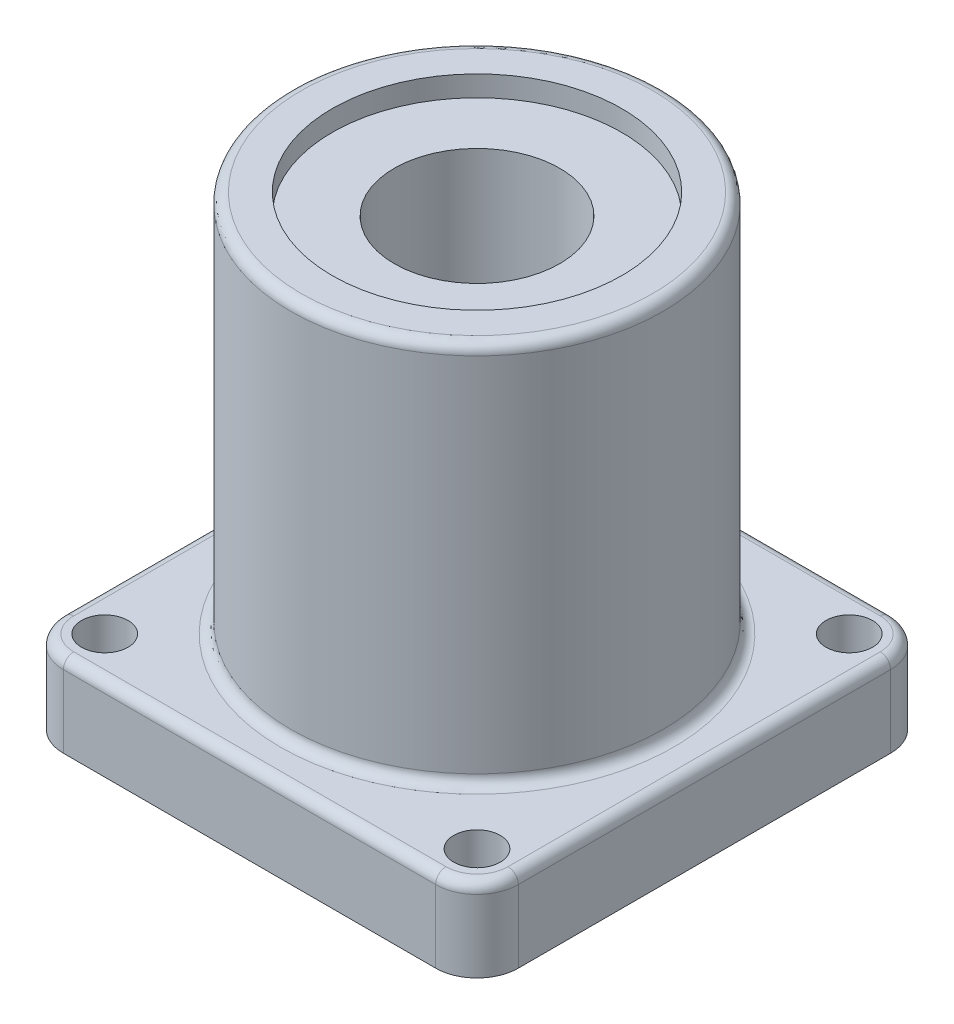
ISO-10303-21;
HEADER;
FILE_DESCRIPTION(('STEP AP214'),'2;1');
FILE_NAME('part.step','',(''),(''),'','','');
FILE_SCHEMA(('AUTOMOTIVE_DESIGN { 1 0 10303 214 1 1 1 1 }'));
ENDSEC;
DATA;
#1=APPLICATION_CONTEXT('core data for automotive mechanical design processes');
#2=APPLICATION_PROTOCOL_DEFINITION('international standard','automotive_design',2000,#1);
#3=PRODUCT_CONTEXT('',#1,'mechanical');
#4=PRODUCT('Part','Part','',(#3));
#5=PRODUCT_RELATED_PRODUCT_CATEGORY('part','',(#4));
#6=PRODUCT_DEFINITION_FORMATION('','',#4);
#7=PRODUCT_DEFINITION_CONTEXT('part definition',#1,'design');
#8=PRODUCT_DEFINITION('design','',#6,#7);
#9=PRODUCT_DEFINITION_SHAPE('','',#8);
#10=(LENGTH_UNIT() NAMED_UNIT(*) SI_UNIT(.MILLI.,.METRE.));
#11=(NAMED_UNIT(*) PLANE_ANGLE_UNIT() SI_UNIT($,.RADIAN.));
#12=(NAMED_UNIT(*) SI_UNIT($,.STERADIAN.) SOLID_ANGLE_UNIT());
#13=UNCERTAINTY_MEASURE_WITH_UNIT(LENGTH_MEASURE(1.E-05),#10,'distance_accuracy_value','');
#14=(GEOMETRIC_REPRESENTATION_CONTEXT(3) GLOBAL_UNCERTAINTY_ASSIGNED_CONTEXT((#13)) GLOBAL_UNIT_ASSIGNED_CONTEXT((#10,
#11,#12)) REPRESENTATION_CONTEXT('',''));
#15=CARTESIAN_POINT('',(0.,0.,0.));
#16=DIRECTION('',(0.,0.,1.));
#17=DIRECTION('',(1.,0.,0.));
#18=AXIS2_PLACEMENT_3D('',#15,#16,#17);
#19=CARTESIAN_POINT('',(0.,0.,0.));
#20=DIRECTION('',(0.,1.,0.));
#21=DIRECTION('',(0.,0.,1.));
#22=AXIS2_PLACEMENT_3D('',#19,#20,#21);
#23=CYLINDRICAL_SURFACE('',#22,12.7);
#24=CARTESIAN_POINT('',(0.,0.,0.));
#25=DIRECTION('',(0.,1.,0.));
#26=DIRECTION('',(0.,0.,1.));
#27=AXIS2_PLACEMENT_3D('',#24,#25,#26);
#28=CIRCLE('',#27,12.7);
#29=CARTESIAN_POINT('',(0.,0.,12.7));
#30=VERTEX_POINT('',#29);
#31=EDGE_CURVE('E281',#30,#30,#28,.T.);
#32=ORIENTED_EDGE('',*,*,#31,.F.);
#33=EDGE_LOOP('',(#32));
#34=FACE_BOUND('',#33,.T.);
#35=CARTESIAN_POINT('',(0.,68.2625,0.));
#36=DIRECTION('',(0.,1.,0.));
#37=DIRECTION('',(0.,0.,1.));
#38=AXIS2_PLACEMENT_3D('',#35,#36,#37);
#39=CIRCLE('',#38,12.7);
#40=CARTESIAN_POINT('',(0.,68.2625,12.7));
#41=VERTEX_POINT('',#40);
#42=EDGE_CURVE('E155',#41,#41,#39,.F.);
#43=ORIENTED_EDGE('',*,*,#42,.F.);
#44=EDGE_LOOP('',(#43));
#45=FACE_BOUND('',#44,.T.);
#46=ADVANCED_FACE('F36',(#34,#45),#23,.F.);
#47=CARTESIAN_POINT('',(-34.925,12.7,34.925));
#48=DIRECTION('',(0.,-1.,0.));
#49=DIRECTION('',(0.,0.,-1.));
#50=AXIS2_PLACEMENT_3D('',#47,#48,#49);
#51=PLANE('',#50);
#52=CARTESIAN_POINT('',(0.,12.7,0.));
#53=DIRECTION('',(0.,-1.,0.));
#54=DIRECTION('',(0.,0.,-1.));
#55=AXIS2_PLACEMENT_3D('',#52,#53,#54);
#56=CIRCLE('',#55,30.1625);
#57=CARTESIAN_POINT('',(0.,12.7,-30.1625));
#58=VERTEX_POINT('',#57);
#59=EDGE_CURVE('E199',#58,#58,#56,.T.);
#60=ORIENTED_EDGE('',*,*,#59,.T.);
#61=EDGE_LOOP('',(#60));
#62=FACE_BOUND('',#61,.T.);
#63=CARTESIAN_POINT('',(-28.575,12.7,-28.575));
#64=DIRECTION('',(0.,-1.,0.));
#65=DIRECTION('',(0.,0.,-1.));
#66=AXIS2_PLACEMENT_3D('',#63,#64,#65);
#67=CIRCLE('',#66,4.7625);
#68=CARTESIAN_POINT('',(-28.575,12.7,-33.3375));
#69=VERTEX_POINT('',#68);
#70=CARTESIAN_POINT('',(-33.3375,12.7,-28.575));
#71=VERTEX_POINT('',#70);
#72=EDGE_CURVE('E194',#69,#71,#67,.F.);
#73=ORIENTED_EDGE('',*,*,#72,.T.);
#74=DIRECTION('',(0.,0.,-1.));
#75=VECTOR('',#74,1.);
#76=CARTESIAN_POINT('',(-33.3375,12.7,28.575));
#77=LINE('',#76,#75);
#78=CARTESIAN_POINT('',(-33.3375,12.7,28.575));
#79=VERTEX_POINT('',#78);
#80=EDGE_CURVE('E196',#71,#79,#77,.F.);
#81=ORIENTED_EDGE('',*,*,#80,.T.);
#82=CARTESIAN_POINT('',(-28.575,12.7,28.575));
#83=DIRECTION('',(0.,-1.,0.));
#84=DIRECTION('',(0.,0.,-1.));
#85=AXIS2_PLACEMENT_3D('',#82,#83,#84);
#86=CIRCLE('',#85,4.7625);
#87=CARTESIAN_POINT('',(-28.575,12.7,33.3375));
#88=VERTEX_POINT('',#87);
#89=EDGE_CURVE('E192',#79,#88,#86,.F.);
#90=ORIENTED_EDGE('',*,*,#89,.T.);
#91=DIRECTION('',(1.,0.,0.));
#92=VECTOR('',#91,1.);
#93=CARTESIAN_POINT('',(-34.925,12.7,33.3375));
#94=LINE('',#93,#92);
#95=CARTESIAN_POINT('',(28.575,12.7,33.3375));
#96=VERTEX_POINT('',#95);
#97=EDGE_CURVE('E188',#88,#96,#94,.T.);
#98=ORIENTED_EDGE('',*,*,#97,.T.);
#99=CARTESIAN_POINT('',(28.575,12.7,28.575));
#100=DIRECTION('',(0.,-1.,0.));
#101=DIRECTION('',(0.,0.,-1.));
#102=AXIS2_PLACEMENT_3D('',#99,#100,#101);
#103=CIRCLE('',#102,4.7625);
#104=CARTESIAN_POINT('',(33.3375,12.7,28.575));
#105=VERTEX_POINT('',#104);
#106=EDGE_CURVE('E184',#96,#105,#103,.F.);
#107=ORIENTED_EDGE('',*,*,#106,.T.);
#108=DIRECTION('',(0.,0.,1.));
#109=VECTOR('',#108,1.);
#110=CARTESIAN_POINT('',(33.3375,12.7,-28.575));
#111=LINE('',#110,#109);
#112=CARTESIAN_POINT('',(33.3375,12.7,-28.575));
#113=VERTEX_POINT('',#112);
#114=EDGE_CURVE('E181',#105,#113,#111,.F.);
#115=ORIENTED_EDGE('',*,*,#114,.T.);
#116=CARTESIAN_POINT('',(28.575,12.7,-28.575));
#117=DIRECTION('',(0.,-1.,0.));
#118=DIRECTION('',(0.,0.,-1.));
#119=AXIS2_PLACEMENT_3D('',#116,#117,#118);
#120=CIRCLE('',#119,4.7625);
#121=CARTESIAN_POINT('',(28.575,12.7,-33.3375));
#122=VERTEX_POINT('',#121);
#123=EDGE_CURVE('E186',#113,#122,#120,.F.);
#124=ORIENTED_EDGE('',*,*,#123,.T.);
#125=DIRECTION('',(-1.,0.,0.));
#126=VECTOR('',#125,1.);
#127=CARTESIAN_POINT('',(-34.925,12.7,-33.3375));
#128=LINE('',#127,#126);
#129=EDGE_CURVE('E190',#122,#69,#128,.T.);
#130=ORIENTED_EDGE('',*,*,#129,.T.);
#131=EDGE_LOOP('',(#73,#81,#90,#98,#107,#115,#124,#130));
#132=FACE_BOUND('',#131,.T.);
#133=CARTESIAN_POINT('',(-28.575,12.7,-28.575));
#134=DIRECTION('',(0.,-1.,0.));
#135=DIRECTION('',(0.,0.,-1.));
#136=AXIS2_PLACEMENT_3D('',#133,#134,#135);
#137=CIRCLE('',#136,3.57187499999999);
#138=CARTESIAN_POINT('',(-28.575,12.7,-32.146875));
#139=VERTEX_POINT('',#138);
#140=EDGE_CURVE('E249',#139,#139,#137,.T.);
#141=ORIENTED_EDGE('',*,*,#140,.T.);
#142=EDGE_LOOP('',(#141));
#143=FACE_BOUND('',#142,.T.);
#144=CARTESIAN_POINT('',(28.575,12.7,-28.575));
#145=DIRECTION('',(0.,-1.,0.));
#146=DIRECTION('',(0.,0.,-1.));
#147=AXIS2_PLACEMENT_3D('',#144,#145,#146);
#148=CIRCLE('',#147,3.57187499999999);
#149=CARTESIAN_POINT('',(28.575,12.7,-32.146875));
#150=VERTEX_POINT('',#149);
#151=EDGE_CURVE('E259',#150,#150,#148,.T.);
#152=ORIENTED_EDGE('',*,*,#151,.T.);
#153=EDGE_LOOP('',(#152));
#154=FACE_BOUND('',#153,.T.);
#155=CARTESIAN_POINT('',(-28.575,12.7,28.575));
#156=DIRECTION('',(0.,-1.,0.));
#157=DIRECTION('',(0.,0.,-1.));
#158=AXIS2_PLACEMENT_3D('',#155,#156,#157);
#159=CIRCLE('',#158,3.57187499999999);
#160=CARTESIAN_POINT('',(-28.575,12.7,25.003125));
#161=VERTEX_POINT('',#160);
#162=EDGE_CURVE('E265',#161,#161,#159,.T.);
#163=ORIENTED_EDGE('',*,*,#162,.T.);
#164=EDGE_LOOP('',(#163));
#165=FACE_BOUND('',#164,.T.);
#166=CARTESIAN_POINT('',(28.575,12.7,28.575));
#167=DIRECTION('',(0.,-1.,0.));
#168=DIRECTION('',(0.,0.,-1.));
#169=AXIS2_PLACEMENT_3D('',#166,#167,#168);
#170=CIRCLE('',#169,3.57187499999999);
#171=CARTESIAN_POINT('',(28.575,12.7,25.003125));
#172=VERTEX_POINT('',#171);
#173=EDGE_CURVE('E271',#172,#172,#170,.T.);
#174=ORIENTED_EDGE('',*,*,#173,.T.);
#175=EDGE_LOOP('',(#174));
#176=FACE_BOUND('',#175,.T.);
#177=ADVANCED_FACE('F316',(#62,#132,#143,#154,#165,#176),#51,.F.);
#178=CARTESIAN_POINT('',(-34.925,12.7,34.925));
#179=DIRECTION('',(-1.,0.,0.));
#180=DIRECTION('',(0.,0.,1.));
#181=AXIS2_PLACEMENT_3D('',#178,#179,#180);
#182=PLANE('',#181);
#183=DIRECTION('',(0.,-1.,0.));
#184=VECTOR('',#183,1.);
#185=CARTESIAN_POINT('',(-34.925,12.7,28.575));
#186=LINE('',#185,#184);
#187=CARTESIAN_POINT('',(-34.925,0.,28.575));
#188=VERTEX_POINT('',#187);
#189=CARTESIAN_POINT('',(-34.925,11.1125,28.575));
#190=VERTEX_POINT('',#189);
#191=EDGE_CURVE('E175',#188,#190,#186,.F.);
#192=ORIENTED_EDGE('',*,*,#191,.T.);
#193=DIRECTION('',(0.,0.,-1.));
#194=VECTOR('',#193,1.);
#195=CARTESIAN_POINT('',(-34.925,11.1125,-28.575));
#196=LINE('',#195,#194);
#197=CARTESIAN_POINT('',(-34.925,11.1125,-28.575));
#198=VERTEX_POINT('',#197);
#199=EDGE_CURVE('E178',#190,#198,#196,.T.);
#200=ORIENTED_EDGE('',*,*,#199,.T.);
#201=DIRECTION('',(0.,-1.,0.));
#202=VECTOR('',#201,1.);
#203=CARTESIAN_POINT('',(-34.925,0.,-28.575));
#204=LINE('',#203,#202);
#205=CARTESIAN_POINT('',(-34.925,0.,-28.575));
#206=VERTEX_POINT('',#205);
#207=EDGE_CURVE('E173',#198,#206,#204,.T.);
#208=ORIENTED_EDGE('',*,*,#207,.T.);
#209=DIRECTION('',(0.,0.,-1.));
#210=VECTOR('',#209,1.);
#211=CARTESIAN_POINT('',(-34.925,0.,34.925));
#212=LINE('',#211,#210);
#213=EDGE_CURVE('E285',#188,#206,#212,.T.);
#214=ORIENTED_EDGE('',*,*,#213,.F.);
#215=EDGE_LOOP('',(#192,#200,#208,#214));
#216=FACE_BOUND('',#215,.T.);
#217=ADVANCED_FACE('F307',(#216),#182,.T.);
#218=CARTESIAN_POINT('',(-34.925,12.7,34.925));
#219=DIRECTION('',(0.,0.,-1.));
#220=DIRECTION('',(-1.,0.,0.));
#221=AXIS2_PLACEMENT_3D('',#218,#219,#220);
#222=PLANE('',#221);
#223=DIRECTION('',(0.,-1.,0.));
#224=VECTOR('',#223,1.);
#225=CARTESIAN_POINT('',(28.575,12.7,34.925));
#226=LINE('',#225,#224);
#227=CARTESIAN_POINT('',(28.575,0.,34.925));
#228=VERTEX_POINT('',#227);
#229=CARTESIAN_POINT('',(28.575,11.1125,34.925));
#230=VERTEX_POINT('',#229);
#231=EDGE_CURVE('E165',#228,#230,#226,.F.);
#232=ORIENTED_EDGE('',*,*,#231,.T.);
#233=DIRECTION('',(1.,0.,0.));
#234=VECTOR('',#233,1.);
#235=CARTESIAN_POINT('',(-34.925,11.1125,34.925));
#236=LINE('',#235,#234);
#237=CARTESIAN_POINT('',(-28.575,11.1125,34.925));
#238=VERTEX_POINT('',#237);
#239=EDGE_CURVE('E208',#230,#238,#236,.F.);
#240=ORIENTED_EDGE('',*,*,#239,.T.);
#241=DIRECTION('',(0.,-1.,0.));
#242=VECTOR('',#241,1.);
#243=CARTESIAN_POINT('',(-28.575,0.,34.925));
#244=LINE('',#243,#242);
#245=CARTESIAN_POINT('',(-28.575,0.,34.925));
#246=VERTEX_POINT('',#245);
#247=EDGE_CURVE('E163',#238,#246,#244,.T.);
#248=ORIENTED_EDGE('',*,*,#247,.T.);
#249=DIRECTION('',(1.,0.,0.));
#250=VECTOR('',#249,1.);
#251=CARTESIAN_POINT('',(-34.925,0.,34.925));
#252=LINE('',#251,#250);
#253=EDGE_CURVE('E144',#246,#228,#252,.T.);
#254=ORIENTED_EDGE('',*,*,#253,.T.);
#255=EDGE_LOOP('',(#232,#240,#248,#254));
#256=FACE_BOUND('',#255,.T.);
#257=ADVANCED_FACE('F362',(#256),#222,.F.);
#258=CARTESIAN_POINT('',(34.925,12.7,-34.925));
#259=DIRECTION('',(1.,0.,0.));
#260=DIRECTION('',(0.,0.,-1.));
#261=AXIS2_PLACEMENT_3D('',#258,#259,#260);
#262=PLANE('',#261);
#263=DIRECTION('',(0.,-1.,0.));
#264=VECTOR('',#263,1.);
#265=CARTESIAN_POINT('',(34.925,12.7,-28.575));
#266=LINE('',#265,#264);
#267=CARTESIAN_POINT('',(34.925,0.,-28.575));
#268=VERTEX_POINT('',#267);
#269=CARTESIAN_POINT('',(34.925,11.1125,-28.575));
#270=VERTEX_POINT('',#269);
#271=EDGE_CURVE('E140',#268,#270,#266,.F.);
#272=ORIENTED_EDGE('',*,*,#271,.T.);
#273=DIRECTION('',(0.,0.,1.));
#274=VECTOR('',#273,1.);
#275=CARTESIAN_POINT('',(34.925,11.1125,28.575));
#276=LINE('',#275,#274);
#277=CARTESIAN_POINT('',(34.925,11.1125,28.575));
#278=VERTEX_POINT('',#277);
#279=EDGE_CURVE('E45',#270,#278,#276,.T.);
#280=ORIENTED_EDGE('',*,*,#279,.T.);
#281=DIRECTION('',(0.,-1.,0.));
#282=VECTOR('',#281,1.);
#283=CARTESIAN_POINT('',(34.925,0.,28.575));
#284=LINE('',#283,#282);
#285=CARTESIAN_POINT('',(34.925,0.,28.575));
#286=VERTEX_POINT('',#285);
#287=EDGE_CURVE('E141',#278,#286,#284,.T.);
#288=ORIENTED_EDGE('',*,*,#287,.T.);
#289=DIRECTION('',(0.,0.,1.));
#290=VECTOR('',#289,1.);
#291=CARTESIAN_POINT('',(34.925,0.,-34.925));
#292=LINE('',#291,#290);
#293=EDGE_CURVE('E132',#268,#286,#292,.T.);
#294=ORIENTED_EDGE('',*,*,#293,.F.);
#295=EDGE_LOOP('',(#272,#280,#288,#294));
#296=FACE_BOUND('',#295,.T.);
#297=ADVANCED_FACE('F139',(#296),#262,.T.);
#298=CARTESIAN_POINT('',(34.925,12.7,-34.925));
#299=DIRECTION('',(0.,0.,1.));
#300=DIRECTION('',(1.,0.,0.));
#301=AXIS2_PLACEMENT_3D('',#298,#299,#300);
#302=PLANE('',#301);
#303=DIRECTION('',(0.,-1.,0.));
#304=VECTOR('',#303,1.);
#305=CARTESIAN_POINT('',(-28.575,12.7,-34.925));
#306=LINE('',#305,#304);
#307=CARTESIAN_POINT('',(-28.575,0.,-34.925));
#308=VERTEX_POINT('',#307);
#309=CARTESIAN_POINT('',(-28.575,11.1125,-34.925));
#310=VERTEX_POINT('',#309);
#311=EDGE_CURVE('E168',#308,#310,#306,.F.);
#312=ORIENTED_EDGE('',*,*,#311,.T.);
#313=DIRECTION('',(-1.,0.,0.));
#314=VECTOR('',#313,1.);
#315=CARTESIAN_POINT('',(34.925,11.1125,-34.925));
#316=LINE('',#315,#314);
#317=CARTESIAN_POINT('',(28.575,11.1125,-34.925));
#318=VERTEX_POINT('',#317);
#319=EDGE_CURVE('E206',#310,#318,#316,.F.);
#320=ORIENTED_EDGE('',*,*,#319,.T.);
#321=DIRECTION('',(0.,-1.,0.));
#322=VECTOR('',#321,1.);
#323=CARTESIAN_POINT('',(28.575,0.,-34.925));
#324=LINE('',#323,#322);
#325=CARTESIAN_POINT('',(28.575,0.,-34.925));
#326=VERTEX_POINT('',#325);
#327=EDGE_CURVE('E171',#318,#326,#324,.T.);
#328=ORIENTED_EDGE('',*,*,#327,.T.);
#329=DIRECTION('',(-1.,0.,0.));
#330=VECTOR('',#329,1.);
#331=CARTESIAN_POINT('',(34.925,0.,-34.925));
#332=LINE('',#331,#330);
#333=EDGE_CURVE('E134',#326,#308,#332,.T.);
#334=ORIENTED_EDGE('',*,*,#333,.T.);
#335=EDGE_LOOP('',(#312,#320,#328,#334));
#336=FACE_BOUND('',#335,.T.);
#337=ADVANCED_FACE('F293',(#336),#302,.F.);
#338=CARTESIAN_POINT('',(-34.925,0.,34.925));
#339=DIRECTION('',(0.,-1.,0.));
#340=DIRECTION('',(0.,0.,-1.));
#341=AXIS2_PLACEMENT_3D('',#338,#339,#340);
#342=PLANE('',#341);
#343=CARTESIAN_POINT('',(-28.575,0.,-28.575));
#344=DIRECTION('',(0.,-1.,0.));
#345=DIRECTION('',(0.,0.,-1.));
#346=AXIS2_PLACEMENT_3D('',#343,#344,#345);
#347=CIRCLE('',#346,3.57187499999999);
#348=CARTESIAN_POINT('',(-28.575,0.,-32.146875));
#349=VERTEX_POINT('',#348);
#350=EDGE_CURVE('E243',#349,#349,#347,.T.);
#351=ORIENTED_EDGE('',*,*,#350,.F.);
#352=EDGE_LOOP('',(#351));
#353=FACE_BOUND('',#352,.T.);
#354=CARTESIAN_POINT('',(28.575,0.,-28.575));
#355=DIRECTION('',(0.,-1.,0.));
#356=DIRECTION('',(0.,0.,-1.));
#357=AXIS2_PLACEMENT_3D('',#354,#355,#356);
#358=CIRCLE('',#357,3.57187499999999);
#359=CARTESIAN_POINT('',(28.575,0.,-32.146875));
#360=VERTEX_POINT('',#359);
#361=EDGE_CURVE('E254',#360,#360,#358,.T.);
#362=ORIENTED_EDGE('',*,*,#361,.F.);
#363=EDGE_LOOP('',(#362));
#364=FACE_BOUND('',#363,.T.);
#365=CARTESIAN_POINT('',(-28.575,0.,28.575));
#366=DIRECTION('',(0.,-1.,0.));
#367=DIRECTION('',(0.,0.,-1.));
#368=AXIS2_PLACEMENT_3D('',#365,#366,#367);
#369=CIRCLE('',#368,3.57187499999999);
#370=CARTESIAN_POINT('',(-28.575,0.,25.003125));
#371=VERTEX_POINT('',#370);
#372=EDGE_CURVE('E262',#371,#371,#369,.T.);
#373=ORIENTED_EDGE('',*,*,#372,.F.);
#374=EDGE_LOOP('',(#373));
#375=FACE_BOUND('',#374,.T.);
#376=CARTESIAN_POINT('',(28.575,0.,28.575));
#377=DIRECTION('',(0.,-1.,0.));
#378=DIRECTION('',(0.,0.,-1.));
#379=AXIS2_PLACEMENT_3D('',#376,#377,#378);
#380=CIRCLE('',#379,3.57187499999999);
#381=CARTESIAN_POINT('',(28.575,0.,25.003125));
#382=VERTEX_POINT('',#381);
#383=EDGE_CURVE('E268',#382,#382,#380,.T.);
#384=ORIENTED_EDGE('',*,*,#383,.F.);
#385=EDGE_LOOP('',(#384));
#386=FACE_BOUND('',#385,.T.);
#387=ORIENTED_EDGE('',*,*,#31,.T.);
#388=EDGE_LOOP('',(#387));
#389=FACE_BOUND('',#388,.T.);
#390=ORIENTED_EDGE('',*,*,#293,.T.);
#391=CARTESIAN_POINT('',(28.575,0.,28.575));
#392=DIRECTION('',(0.,-1.,0.));
#393=DIRECTION('',(0.,0.,-1.));
#394=AXIS2_PLACEMENT_3D('',#391,#392,#393);
#395=CIRCLE('',#394,6.35);
#396=EDGE_CURVE('E136',#286,#228,#395,.T.);
#397=ORIENTED_EDGE('',*,*,#396,.T.);
#398=ORIENTED_EDGE('',*,*,#253,.F.);
#399=CARTESIAN_POINT('',(-28.575,0.,28.575));
#400=DIRECTION('',(0.,-1.,0.));
#401=DIRECTION('',(0.,0.,-1.));
#402=AXIS2_PLACEMENT_3D('',#399,#400,#401);
#403=CIRCLE('',#402,6.35);
#404=EDGE_CURVE('E137',#246,#188,#403,.T.);
#405=ORIENTED_EDGE('',*,*,#404,.T.);
#406=ORIENTED_EDGE('',*,*,#213,.T.);
#407=CARTESIAN_POINT('',(-28.575,0.,-28.575));
#408=DIRECTION('',(0.,-1.,0.));
#409=DIRECTION('',(0.,0.,-1.));
#410=AXIS2_PLACEMENT_3D('',#407,#408,#409);
#411=CIRCLE('',#410,6.35);
#412=EDGE_CURVE('E149',#206,#308,#411,.T.);
#413=ORIENTED_EDGE('',*,*,#412,.T.);
#414=ORIENTED_EDGE('',*,*,#333,.F.);
#415=CARTESIAN_POINT('',(28.575,0.,-28.575));
#416=DIRECTION('',(0.,-1.,0.));
#417=DIRECTION('',(0.,0.,-1.));
#418=AXIS2_PLACEMENT_3D('',#415,#416,#417);
#419=CIRCLE('',#418,6.35);
#420=EDGE_CURVE('E129',#326,#268,#419,.T.);
#421=ORIENTED_EDGE('',*,*,#420,.T.);
#422=EDGE_LOOP('',(#390,#397,#398,#405,#406,#413,#414,#421));
#423=FACE_BOUND('',#422,.T.);
#424=ADVANCED_FACE('F131',(#353,#364,#375,#386,#389,#423),#342,.T.);
#425=CARTESIAN_POINT('',(0.,71.4375,0.));
#426=DIRECTION('',(0.,-1.,0.));
#427=DIRECTION('',(0.,0.,-1.));
#428=AXIS2_PLACEMENT_3D('',#425,#426,#427);
#429=CYLINDRICAL_SURFACE('',#428,28.575);
#430=CARTESIAN_POINT('',(0.,14.2875,0.));
#431=DIRECTION('',(0.,-1.,0.));
#432=DIRECTION('',(0.,0.,-1.));
#433=AXIS2_PLACEMENT_3D('',#430,#431,#432);
#434=CIRCLE('',#433,28.575);
#435=CARTESIAN_POINT('',(0.,14.2875,-28.575));
#436=VERTEX_POINT('',#435);
#437=EDGE_CURVE('E216',#436,#436,#434,.F.);
#438=ORIENTED_EDGE('',*,*,#437,.T.);
#439=EDGE_LOOP('',(#438));
#440=FACE_BOUND('',#439,.T.);
#441=CARTESIAN_POINT('',(0.,69.85,0.));
#442=DIRECTION('',(0.,1.,0.));
#443=DIRECTION('',(0.,0.,1.));
#444=AXIS2_PLACEMENT_3D('',#441,#442,#443);
#445=CIRCLE('',#444,28.575);
#446=CARTESIAN_POINT('',(0.,69.85,28.575));
#447=VERTEX_POINT('',#446);
#448=EDGE_CURVE('E213',#447,#447,#445,.F.);
#449=ORIENTED_EDGE('',*,*,#448,.T.);
#450=EDGE_LOOP('',(#449));
#451=FACE_BOUND('',#450,.T.);
#452=ADVANCED_FACE('F354',(#440,#451),#429,.T.);
#453=CARTESIAN_POINT('',(0.,71.4375,0.));
#454=DIRECTION('',(0.,1.,0.));
#455=DIRECTION('',(0.,0.,1.));
#456=AXIS2_PLACEMENT_3D('',#453,#454,#455);
#457=PLANE('',#456);
#458=CARTESIAN_POINT('',(0.,71.4375,0.));
#459=DIRECTION('',(0.,1.,0.));
#460=DIRECTION('',(0.,0.,1.));
#461=AXIS2_PLACEMENT_3D('',#458,#459,#460);
#462=CIRCLE('',#461,26.9875);
#463=CARTESIAN_POINT('',(0.,71.4375,26.9875));
#464=VERTEX_POINT('',#463);
#465=EDGE_CURVE('E11',#464,#464,#462,.T.);
#466=ORIENTED_EDGE('',*,*,#465,.T.);
#467=EDGE_LOOP('',(#466));
#468=FACE_BOUND('',#467,.T.);
#469=CARTESIAN_POINT('',(0.,71.4375,0.));
#470=DIRECTION('',(0.,1.,0.));
#471=DIRECTION('',(0.,0.,1.));
#472=AXIS2_PLACEMENT_3D('',#469,#470,#471);
#473=CIRCLE('',#472,22.225);
#474=CARTESIAN_POINT('',(0.,71.4375,22.225));
#475=VERTEX_POINT('',#474);
#476=EDGE_CURVE('E275',#475,#475,#473,.T.);
#477=ORIENTED_EDGE('',*,*,#476,.F.);
#478=EDGE_LOOP('',(#477));
#479=FACE_BOUND('',#478,.T.);
#480=ADVANCED_FACE('F350',(#468,#479),#457,.T.);
#481=CARTESIAN_POINT('',(0.,68.2625,0.));
#482=DIRECTION('',(0.,1.,0.));
#483=DIRECTION('',(0.,0.,1.));
#484=AXIS2_PLACEMENT_3D('',#481,#482,#483);
#485=PLANE('',#484);
#486=CARTESIAN_POINT('',(0.,68.2625,0.));
#487=DIRECTION('',(0.,1.,0.));
#488=DIRECTION('',(0.,0.,1.));
#489=AXIS2_PLACEMENT_3D('',#486,#487,#488);
#490=CIRCLE('',#489,22.225);
#491=CARTESIAN_POINT('',(0.,68.2625,22.225));
#492=VERTEX_POINT('',#491);
#493=EDGE_CURVE('E276',#492,#492,#490,.T.);
#494=ORIENTED_EDGE('',*,*,#493,.T.);
#495=EDGE_LOOP('',(#494));
#496=FACE_BOUND('',#495,.T.);
#497=ORIENTED_EDGE('',*,*,#42,.T.);
#498=EDGE_LOOP('',(#497));
#499=FACE_BOUND('',#498,.T.);
#500=ADVANCED_FACE('F353',(#496,#499),#485,.T.);
#501=CARTESIAN_POINT('',(0.,68.2625,0.));
#502=DIRECTION('',(0.,1.,0.));
#503=DIRECTION('',(0.,0.,1.));
#504=AXIS2_PLACEMENT_3D('',#501,#502,#503);
#505=CYLINDRICAL_SURFACE('',#504,22.225);
#506=ORIENTED_EDGE('',*,*,#493,.F.);
#507=EDGE_LOOP('',(#506));
#508=FACE_BOUND('',#507,.T.);
#509=ORIENTED_EDGE('',*,*,#476,.T.);
#510=EDGE_LOOP('',(#509));
#511=FACE_BOUND('',#510,.T.);
#512=ADVANCED_FACE('F348',(#508,#511),#505,.F.);
#513=CARTESIAN_POINT('',(28.575,12.7,28.575));
#514=DIRECTION('',(0.,1.,0.));
#515=DIRECTION('',(0.,0.,1.));
#516=AXIS2_PLACEMENT_3D('',#513,#514,#515);
#517=CYLINDRICAL_SURFACE('',#516,6.35);
#518=ORIENTED_EDGE('',*,*,#287,.F.);
#519=CARTESIAN_POINT('',(28.575,11.1125,28.575));
#520=DIRECTION('',(0.,-1.,0.));
#521=DIRECTION('',(0.,0.,-1.));
#522=AXIS2_PLACEMENT_3D('',#519,#520,#521);
#523=CIRCLE('',#522,6.35);
#524=EDGE_CURVE('E211',#278,#230,#523,.T.);
#525=ORIENTED_EDGE('',*,*,#524,.T.);
#526=ORIENTED_EDGE('',*,*,#231,.F.);
#527=ORIENTED_EDGE('',*,*,#396,.F.);
#528=EDGE_LOOP('',(#518,#525,#526,#527));
#529=FACE_BOUND('',#528,.T.);
#530=ADVANCED_FACE('F372',(#529),#517,.T.);
#531=CARTESIAN_POINT('',(28.575,12.7,-28.575));
#532=DIRECTION('',(0.,1.,0.));
#533=DIRECTION('',(0.,0.,1.));
#534=AXIS2_PLACEMENT_3D('',#531,#532,#533);
#535=CYLINDRICAL_SURFACE('',#534,6.35);
#536=ORIENTED_EDGE('',*,*,#327,.F.);
#537=CARTESIAN_POINT('',(28.575,11.1125,-28.575));
#538=DIRECTION('',(0.,-1.,0.));
#539=DIRECTION('',(0.,0.,-1.));
#540=AXIS2_PLACEMENT_3D('',#537,#538,#539);
#541=CIRCLE('',#540,6.35);
#542=EDGE_CURVE('E60',#318,#270,#541,.T.);
#543=ORIENTED_EDGE('',*,*,#542,.T.);
#544=ORIENTED_EDGE('',*,*,#271,.F.);
#545=ORIENTED_EDGE('',*,*,#420,.F.);
#546=EDGE_LOOP('',(#536,#543,#544,#545));
#547=FACE_BOUND('',#546,.T.);
#548=ADVANCED_FACE('F146',(#547),#535,.T.);
#549=CARTESIAN_POINT('',(-28.575,12.7,28.575));
#550=DIRECTION('',(0.,1.,0.));
#551=DIRECTION('',(0.,0.,1.));
#552=AXIS2_PLACEMENT_3D('',#549,#550,#551);
#553=CYLINDRICAL_SURFACE('',#552,6.35);
#554=ORIENTED_EDGE('',*,*,#247,.F.);
#555=CARTESIAN_POINT('',(-28.575,11.1125,28.575));
#556=DIRECTION('',(0.,-1.,0.));
#557=DIRECTION('',(0.,0.,-1.));
#558=AXIS2_PLACEMENT_3D('',#555,#556,#557);
#559=CIRCLE('',#558,6.35);
#560=EDGE_CURVE('E204',#238,#190,#559,.T.);
#561=ORIENTED_EDGE('',*,*,#560,.T.);
#562=ORIENTED_EDGE('',*,*,#191,.F.);
#563=ORIENTED_EDGE('',*,*,#404,.F.);
#564=EDGE_LOOP('',(#554,#561,#562,#563));
#565=FACE_BOUND('',#564,.T.);
#566=ADVANCED_FACE('F378',(#565),#553,.T.);
#567=CARTESIAN_POINT('',(-28.575,12.7,-28.575));
#568=DIRECTION('',(0.,1.,0.));
#569=DIRECTION('',(0.,0.,1.));
#570=AXIS2_PLACEMENT_3D('',#567,#568,#569);
#571=CYLINDRICAL_SURFACE('',#570,6.35);
#572=ORIENTED_EDGE('',*,*,#207,.F.);
#573=CARTESIAN_POINT('',(-28.575,11.1125,-28.575));
#574=DIRECTION('',(0.,-1.,0.));
#575=DIRECTION('',(0.,0.,-1.));
#576=AXIS2_PLACEMENT_3D('',#573,#574,#575);
#577=CIRCLE('',#576,6.35);
#578=EDGE_CURVE('E202',#198,#310,#577,.T.);
#579=ORIENTED_EDGE('',*,*,#578,.T.);
#580=ORIENTED_EDGE('',*,*,#311,.F.);
#581=ORIENTED_EDGE('',*,*,#412,.F.);
#582=EDGE_LOOP('',(#572,#579,#580,#581));
#583=FACE_BOUND('',#582,.T.);
#584=ADVANCED_FACE('F298',(#583),#571,.T.);
#585=CARTESIAN_POINT('',(28.575,71.4375,28.575));
#586=DIRECTION('',(0.,-1.,0.));
#587=DIRECTION('',(0.,0.,-1.));
#588=AXIS2_PLACEMENT_3D('',#585,#586,#587);
#589=CYLINDRICAL_SURFACE('',#588,3.57187499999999);
#590=ORIENTED_EDGE('',*,*,#383,.T.);
#591=EDGE_LOOP('',(#590));
#592=FACE_BOUND('',#591,.T.);
#593=ORIENTED_EDGE('',*,*,#173,.F.);
#594=EDGE_LOOP('',(#593));
#595=FACE_BOUND('',#594,.T.);
#596=ADVANCED_FACE('F384',(#592,#595),#589,.F.);
#597=CARTESIAN_POINT('',(-28.575,71.4375,28.575));
#598=DIRECTION('',(0.,-1.,0.));
#599=DIRECTION('',(0.,0.,-1.));
#600=AXIS2_PLACEMENT_3D('',#597,#598,#599);
#601=CYLINDRICAL_SURFACE('',#600,3.57187499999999);
#602=ORIENTED_EDGE('',*,*,#372,.T.);
#603=EDGE_LOOP('',(#602));
#604=FACE_BOUND('',#603,.T.);
#605=ORIENTED_EDGE('',*,*,#162,.F.);
#606=EDGE_LOOP('',(#605));
#607=FACE_BOUND('',#606,.T.);
#608=ADVANCED_FACE('F479',(#604,#607),#601,.F.);
#609=CARTESIAN_POINT('',(28.575,71.4375,-28.575));
#610=DIRECTION('',(0.,-1.,0.));
#611=DIRECTION('',(0.,0.,-1.));
#612=AXIS2_PLACEMENT_3D('',#609,#610,#611);
#613=CYLINDRICAL_SURFACE('',#612,3.57187499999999);
#614=ORIENTED_EDGE('',*,*,#361,.T.);
#615=EDGE_LOOP('',(#614));
#616=FACE_BOUND('',#615,.T.);
#617=ORIENTED_EDGE('',*,*,#151,.F.);
#618=EDGE_LOOP('',(#617));
#619=FACE_BOUND('',#618,.T.);
#620=ADVANCED_FACE('F470',(#616,#619),#613,.F.);
#621=CARTESIAN_POINT('',(-28.575,71.4375,-28.575));
#622=DIRECTION('',(0.,-1.,0.));
#623=DIRECTION('',(0.,0.,-1.));
#624=AXIS2_PLACEMENT_3D('',#621,#622,#623);
#625=CYLINDRICAL_SURFACE('',#624,3.57187499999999);
#626=ORIENTED_EDGE('',*,*,#350,.T.);
#627=EDGE_LOOP('',(#626));
#628=FACE_BOUND('',#627,.T.);
#629=ORIENTED_EDGE('',*,*,#140,.F.);
#630=EDGE_LOOP('',(#629));
#631=FACE_BOUND('',#630,.T.);
#632=ADVANCED_FACE('F459',(#628,#631),#625,.F.);
#633=CARTESIAN_POINT('',(33.3375,11.1125,-34.925));
#634=DIRECTION('',(0.,0.,-1.));
#635=DIRECTION('',(-1.,0.,0.));
#636=AXIS2_PLACEMENT_3D('',#633,#634,#635);
#637=CYLINDRICAL_SURFACE('',#636,1.5875);
#638=CARTESIAN_POINT('',(33.3375,11.1125,-28.575));
#639=DIRECTION('',(0.,0.,-1.));
#640=DIRECTION('',(-1.,0.,0.));
#641=AXIS2_PLACEMENT_3D('',#638,#639,#640);
#642=CIRCLE('',#641,1.5875);
#643=EDGE_CURVE('E237',#113,#270,#642,.T.);
#644=ORIENTED_EDGE('',*,*,#643,.F.);
#645=ORIENTED_EDGE('',*,*,#114,.F.);
#646=CARTESIAN_POINT('',(33.3375,11.1125,28.575));
#647=DIRECTION('',(0.,0.,1.));
#648=DIRECTION('',(1.,0.,0.));
#649=AXIS2_PLACEMENT_3D('',#646,#647,#648);
#650=CIRCLE('',#649,1.5875);
#651=EDGE_CURVE('E40',#278,#105,#650,.T.);
#652=ORIENTED_EDGE('',*,*,#651,.F.);
#653=ORIENTED_EDGE('',*,*,#279,.F.);
#654=EDGE_LOOP('',(#644,#645,#652,#653));
#655=FACE_BOUND('',#654,.T.);
#656=ADVANCED_FACE('F334',(#655),#637,.T.);
#657=CARTESIAN_POINT('',(28.575,11.1125,28.575));
#658=DIRECTION('',(0.,-1.,0.));
#659=DIRECTION('',(0.,0.,-1.));
#660=AXIS2_PLACEMENT_3D('',#657,#658,#659);
#661=TOROIDAL_SURFACE('',#660,4.7625,1.5875);
#662=ORIENTED_EDGE('',*,*,#651,.T.);
#663=ORIENTED_EDGE('',*,*,#106,.F.);
#664=CARTESIAN_POINT('',(28.575,11.1125,33.3375));
#665=DIRECTION('',(-1.,0.,0.));
#666=DIRECTION('',(0.,0.,1.));
#667=AXIS2_PLACEMENT_3D('',#664,#665,#666);
#668=CIRCLE('',#667,1.5875);
#669=EDGE_CURVE('E235',#230,#96,#668,.T.);
#670=ORIENTED_EDGE('',*,*,#669,.F.);
#671=ORIENTED_EDGE('',*,*,#524,.F.);
#672=EDGE_LOOP('',(#662,#663,#670,#671));
#673=FACE_BOUND('',#672,.T.);
#674=ADVANCED_FACE('F326',(#673),#661,.T.);
#675=CARTESIAN_POINT('',(28.575,11.1125,-28.575));
#676=DIRECTION('',(0.,-1.,0.));
#677=DIRECTION('',(0.,0.,-1.));
#678=AXIS2_PLACEMENT_3D('',#675,#676,#677);
#679=TOROIDAL_SURFACE('',#678,4.7625,1.5875);
#680=ORIENTED_EDGE('',*,*,#643,.T.);
#681=ORIENTED_EDGE('',*,*,#542,.F.);
#682=CARTESIAN_POINT('',(28.575,11.1125,-33.3375));
#683=DIRECTION('',(-1.,0.,0.));
#684=DIRECTION('',(0.,0.,1.));
#685=AXIS2_PLACEMENT_3D('',#682,#683,#684);
#686=CIRCLE('',#685,1.5875);
#687=EDGE_CURVE('E232',#122,#318,#686,.T.);
#688=ORIENTED_EDGE('',*,*,#687,.F.);
#689=ORIENTED_EDGE('',*,*,#123,.F.);
#690=EDGE_LOOP('',(#680,#681,#688,#689));
#691=FACE_BOUND('',#690,.T.);
#692=ADVANCED_FACE('F323',(#691),#679,.T.);
#693=CARTESIAN_POINT('',(-34.925,11.1125,33.3375));
#694=DIRECTION('',(1.,0.,0.));
#695=DIRECTION('',(0.,0.,-1.));
#696=AXIS2_PLACEMENT_3D('',#693,#694,#695);
#697=CYLINDRICAL_SURFACE('',#696,1.5875);
#698=ORIENTED_EDGE('',*,*,#669,.T.);
#699=ORIENTED_EDGE('',*,*,#97,.F.);
#700=CARTESIAN_POINT('',(-28.575,11.1125,33.3375));
#701=DIRECTION('',(-1.,0.,0.));
#702=DIRECTION('',(0.,0.,1.));
#703=AXIS2_PLACEMENT_3D('',#700,#701,#702);
#704=CIRCLE('',#703,1.5875);
#705=EDGE_CURVE('E229',#238,#88,#704,.T.);
#706=ORIENTED_EDGE('',*,*,#705,.F.);
#707=ORIENTED_EDGE('',*,*,#239,.F.);
#708=EDGE_LOOP('',(#698,#699,#706,#707));
#709=FACE_BOUND('',#708,.T.);
#710=ADVANCED_FACE('F325',(#709),#697,.T.);
#711=CARTESIAN_POINT('',(-34.925,11.1125,-33.3375));
#712=DIRECTION('',(-1.,0.,0.));
#713=DIRECTION('',(0.,0.,1.));
#714=AXIS2_PLACEMENT_3D('',#711,#712,#713);
#715=CYLINDRICAL_SURFACE('',#714,1.5875);
#716=ORIENTED_EDGE('',*,*,#687,.T.);
#717=ORIENTED_EDGE('',*,*,#319,.F.);
#718=CARTESIAN_POINT('',(-28.575,11.1125,-33.3375));
#719=DIRECTION('',(-1.,0.,0.));
#720=DIRECTION('',(0.,0.,1.));
#721=AXIS2_PLACEMENT_3D('',#718,#719,#720);
#722=CIRCLE('',#721,1.5875);
#723=EDGE_CURVE('E226',#69,#310,#722,.T.);
#724=ORIENTED_EDGE('',*,*,#723,.F.);
#725=ORIENTED_EDGE('',*,*,#129,.F.);
#726=EDGE_LOOP('',(#716,#717,#724,#725));
#727=FACE_BOUND('',#726,.T.);
#728=ADVANCED_FACE('F322',(#727),#715,.T.);
#729=CARTESIAN_POINT('',(-28.575,11.1125,28.575));
#730=DIRECTION('',(0.,-1.,0.));
#731=DIRECTION('',(0.,0.,-1.));
#732=AXIS2_PLACEMENT_3D('',#729,#730,#731);
#733=TOROIDAL_SURFACE('',#732,4.7625,1.5875);
#734=ORIENTED_EDGE('',*,*,#705,.T.);
#735=ORIENTED_EDGE('',*,*,#89,.F.);
#736=CARTESIAN_POINT('',(-33.3375,11.1125,28.575));
#737=DIRECTION('',(0.,0.,-1.));
#738=DIRECTION('',(-1.,0.,0.));
#739=AXIS2_PLACEMENT_3D('',#736,#737,#738);
#740=CIRCLE('',#739,1.5875);
#741=EDGE_CURVE('E224',#190,#79,#740,.T.);
#742=ORIENTED_EDGE('',*,*,#741,.F.);
#743=ORIENTED_EDGE('',*,*,#560,.F.);
#744=EDGE_LOOP('',(#734,#735,#742,#743));
#745=FACE_BOUND('',#744,.T.);
#746=ADVANCED_FACE('F390',(#745),#733,.T.);
#747=CARTESIAN_POINT('',(-28.575,11.1125,-28.575));
#748=DIRECTION('',(0.,-1.,0.));
#749=DIRECTION('',(0.,0.,-1.));
#750=AXIS2_PLACEMENT_3D('',#747,#748,#749);
#751=TOROIDAL_SURFACE('',#750,4.7625,1.5875);
#752=ORIENTED_EDGE('',*,*,#723,.T.);
#753=ORIENTED_EDGE('',*,*,#578,.F.);
#754=CARTESIAN_POINT('',(-33.3375,11.1125,-28.575));
#755=DIRECTION('',(0.,0.,1.));
#756=DIRECTION('',(1.,0.,0.));
#757=AXIS2_PLACEMENT_3D('',#754,#755,#756);
#758=CIRCLE('',#757,1.5875);
#759=EDGE_CURVE('E222',#71,#198,#758,.T.);
#760=ORIENTED_EDGE('',*,*,#759,.F.);
#761=ORIENTED_EDGE('',*,*,#72,.F.);
#762=EDGE_LOOP('',(#752,#753,#760,#761));
#763=FACE_BOUND('',#762,.T.);
#764=ADVANCED_FACE('F302',(#763),#751,.T.);
#765=CARTESIAN_POINT('',(-33.3375,11.1125,34.925));
#766=DIRECTION('',(0.,0.,1.));
#767=DIRECTION('',(1.,0.,0.));
#768=AXIS2_PLACEMENT_3D('',#765,#766,#767);
#769=CYLINDRICAL_SURFACE('',#768,1.5875);
#770=ORIENTED_EDGE('',*,*,#741,.T.);
#771=ORIENTED_EDGE('',*,*,#80,.F.);
#772=ORIENTED_EDGE('',*,*,#759,.T.);
#773=ORIENTED_EDGE('',*,*,#199,.F.);
#774=EDGE_LOOP('',(#770,#771,#772,#773));
#775=FACE_BOUND('',#774,.T.);
#776=ADVANCED_FACE('F312',(#775),#769,.T.);
#777=CARTESIAN_POINT('',(0.,14.2875,0.));
#778=DIRECTION('',(0.,-1.,0.));
#779=DIRECTION('',(0.,0.,-1.));
#780=AXIS2_PLACEMENT_3D('',#777,#778,#779);
#781=TOROIDAL_SURFACE('',#780,30.1625,1.5875);
#782=ORIENTED_EDGE('',*,*,#59,.F.);
#783=EDGE_LOOP('',(#782));
#784=FACE_BOUND('',#783,.T.);
#785=ORIENTED_EDGE('',*,*,#437,.F.);
#786=EDGE_LOOP('',(#785));
#787=FACE_BOUND('',#786,.T.);
#788=ADVANCED_FACE('F387',(#784,#787),#781,.F.);
#789=CARTESIAN_POINT('',(0.,69.85,0.));
#790=DIRECTION('',(0.,1.,0.));
#791=DIRECTION('',(0.,0.,1.));
#792=AXIS2_PLACEMENT_3D('',#789,#790,#791);
#793=TOROIDAL_SURFACE('',#792,26.9875,1.5875);
#794=ORIENTED_EDGE('',*,*,#448,.F.);
#795=EDGE_LOOP('',(#794));
#796=FACE_BOUND('',#795,.T.);
#797=ORIENTED_EDGE('',*,*,#465,.F.);
#798=EDGE_LOOP('',(#797));
#799=FACE_BOUND('',#798,.T.);
#800=ADVANCED_FACE('F38',(#796,#799),#793,.T.);
#801=CLOSED_SHELL('',(#46,#177,#217,#257,#297,#337,#424,#452,#480,#500,#512,#530,#548,#566,#584,
#596,#608,#620,#632,#656,#674,#692,#710,#728,#746,#764,#776,#788,#800));
#802=MANIFOLD_SOLID_BREP('B2',#801);
#803=ADVANCED_BREP_SHAPE_REPRESENTATION('',(#18,#802),#14);
#804=SHAPE_DEFINITION_REPRESENTATION(#9,#803);
ENDSEC;
END-ISO-10303-21;
